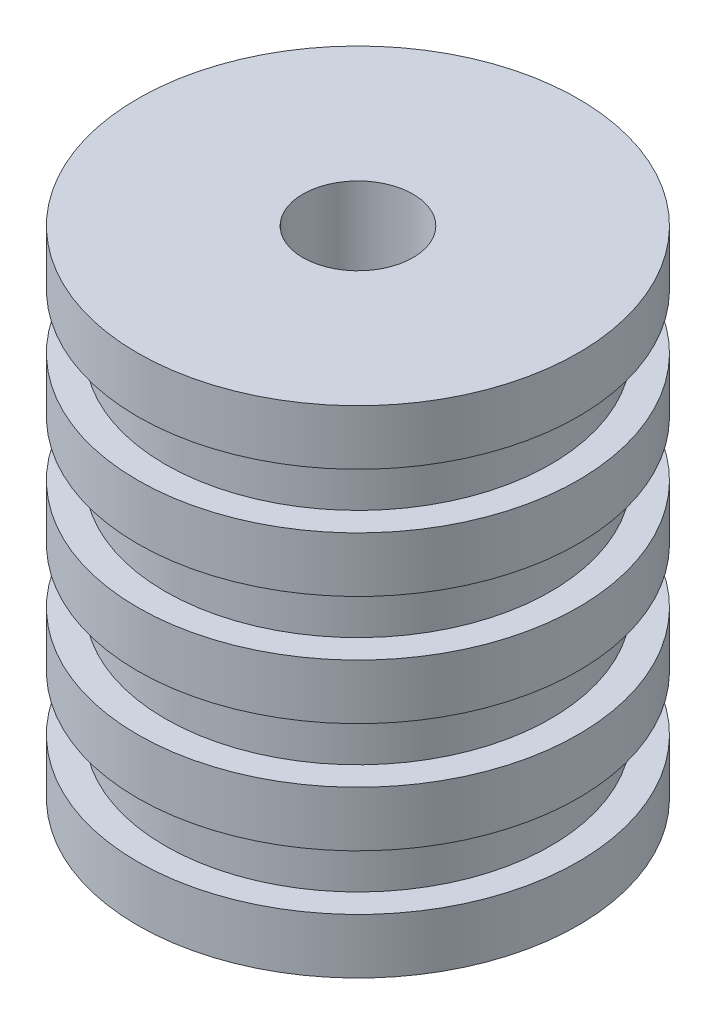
from build123d import *


with BuildPart() as part:
    # Sketch1 → Revolve1 (revolve)
    with BuildSketch(Plane.XY, mode=Mode.PRIVATE) as revolve1_sk:
        Polygon((20, 0), (80, 0), (80, -20), (70, -20), (70, -40), (80, -40), (80, -60), (70, -60), (70, -80), (80, -80), (80, -100), (70, -100), (70, -120), (80, -120), (80, -140), (70, -140), (70, -160), (80, -160), (80, -180), (20, -180), align=None)
    revolve(revolve1_sk.sketch.rotate(Axis((0, 0, 0), (0, -1, 0)), 90), axis=Axis((0, 0, 0), (0, -1, 0)))


solid = part.part
